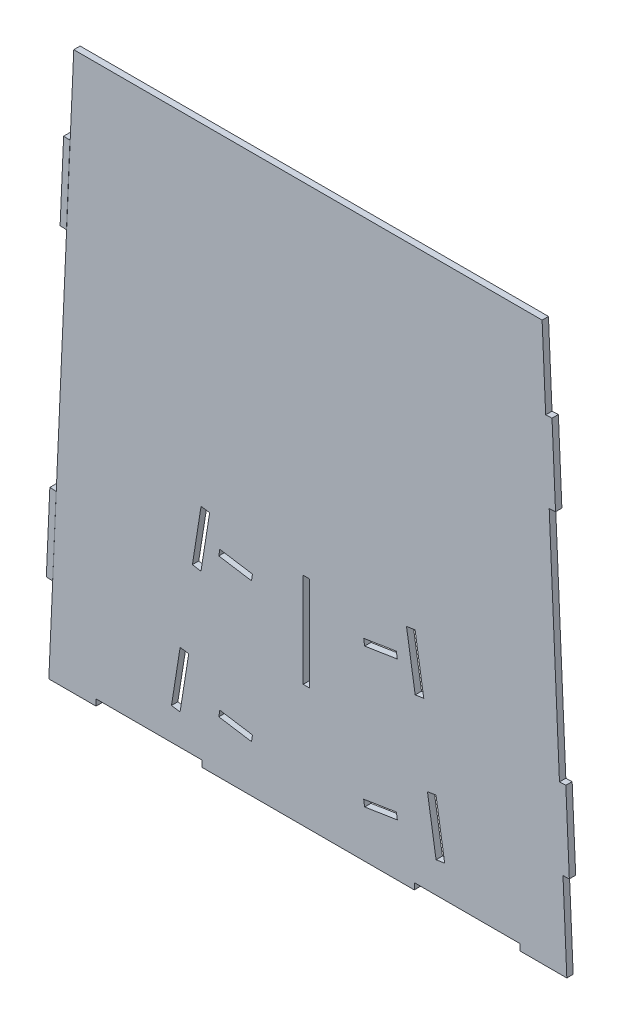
from build123d import *

# Parameters (mm, degrees)
BOSS_EXTRUDE1_DEPTH = 1.524
BOSS_EXTRUDE2_DEPTH = 1.524
SKETCH6_W           = 25.4
SKETCH6_H           = 1.524
CUT_EXTRUDE3_DEPTH  = 1.524
SKETCH7_W           = 1.524
SKETCH7_H           = 22.658950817
CUT_EXTRUDE4_DEPTH  = 1.524


with BuildPart() as part:
    # Sketch1 → Boss-Extrude1 (new body)
    with BuildSketch(Plane.XY):
        Polygon((-62.105258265, -13.26978038), (-56.120792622, 120.430311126), (56.212958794, 120.430311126), (62.142082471, -13.26978038), align=None)
    extrude(amount=BOSS_EXTRUDE1_DEPTH)

    # Sketch2 → Boss-Extrude2 (add)
    with BuildSketch(Plane.XY.offset(1.524)):
        Polygon((-62.70469272, 7.612691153), (-61.860722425, 26.643986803), (-60.338218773, 26.57646918), (-61.182189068, 7.545173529), align=None)
        Polygon((57.910805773, 82.144333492), (59.433309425, 82.211851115), (58.589339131, 101.243146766), (57.066835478, 101.175629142), align=None)
        Polygon((61.219013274, 7.545173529), (62.741516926, 7.612691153), (61.897546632, 26.643986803), (60.375042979, 26.57646918), align=None)
        Polygon((-59.396485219, 82.211851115), (-58.552514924, 101.243146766), (-57.030011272, 101.175629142), (-57.873981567, 82.144333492), align=None)
    extrude(amount=-BOSS_EXTRUDE2_DEPTH)


with BuildPart() as boss_extrude2_piece_1:
    # of the separate pieces the step leaves, piece 1, a body of its own (boss_extrude2_pieces)
    add(part.part.solids().sort_by_distance((-62.105258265, -13.26978038, 0))[0])

    # Sketch6 → Cut-Extrude3 (cut)
    with BuildSketch(Plane.XY.offset(1.524)):
        with Locations((38.24729306, -12.50778038)):
            Rectangle(SKETCH6_W, SKETCH6_H)
        with Locations((-38.091018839, -12.50778038)):
            Rectangle(SKETCH6_W, SKETCH6_H)
    extrude(amount=-CUT_EXTRUDE3_DEPTH, mode=Mode.SUBTRACT)

    # Sketch7 → Cut-Extrude4 (cut)
    with BuildSketch(Plane(origin=(0, 0, 0), x_dir=(-1, 0, 0), z_dir=(0, 0, -1))):
        Polygon((25.587096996, 40.859117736), (27.668066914, 27.678226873), (25.612061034, 27.353629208), (23.531091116, 40.534520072), align=None)
        Polygon((30.609989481, 9.04405059), (32.67894736, -4.060755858), (30.622941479, -4.385353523), (28.553983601, 8.719452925), align=None)
        Polygon((-30.766174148, 9.04405059), (-32.835132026, -4.060755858), (-30.779126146, -4.385353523), (-28.710168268, 8.719452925), align=None)
        Polygon((-25.743281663, 40.859117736), (-27.824251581, 27.678226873), (-25.7682457, 27.353629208), (-23.687275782, 40.534520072), align=None)
        with Locations((0.33065945, 27.440564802)):
            Rectangle(SKETCH7_W, SKETCH7_H)
        Polygon((-21.489779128, 32.661431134), (-13.649390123, 31.423607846), (-13.411728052, 32.928962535), (-21.252117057, 34.166785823), align=None)
        Polygon((-21.489779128, -0.752677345), (-13.649390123, -1.990500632), (-13.411728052, -0.485145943), (-21.252117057, 0.752677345), align=None)
        Polygon((13.493205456, -1.990500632), (13.255543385, -0.485145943), (21.09593239, 0.752677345), (21.333594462, -0.752677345), align=None)
        Polygon((13.493205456, 31.423607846), (13.255543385, 32.928962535), (21.09593239, 34.166785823), (21.333594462, 32.661431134), align=None)
    extrude(amount=-CUT_EXTRUDE4_DEPTH, mode=Mode.SUBTRACT)


with BuildPart() as boss_extrude2_piece_2:
    # of the separate pieces the step leaves, piece 2, a body of its own (boss_extrude2_pieces)
    add(part.part.solids().sort_by_distance((-59.396485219, 82.211851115, 1.524))[0])


with BuildPart() as boss_extrude2_piece_3:
    # of the separate pieces the step leaves, piece 3, a body of its own (boss_extrude2_pieces)
    add(part.part.solids().sort_by_distance((-62.70469272, 7.612691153, 1.524))[0])


solid = Compound([boss_extrude2_piece_1.part, boss_extrude2_piece_2.part, boss_extrude2_piece_3.part])
